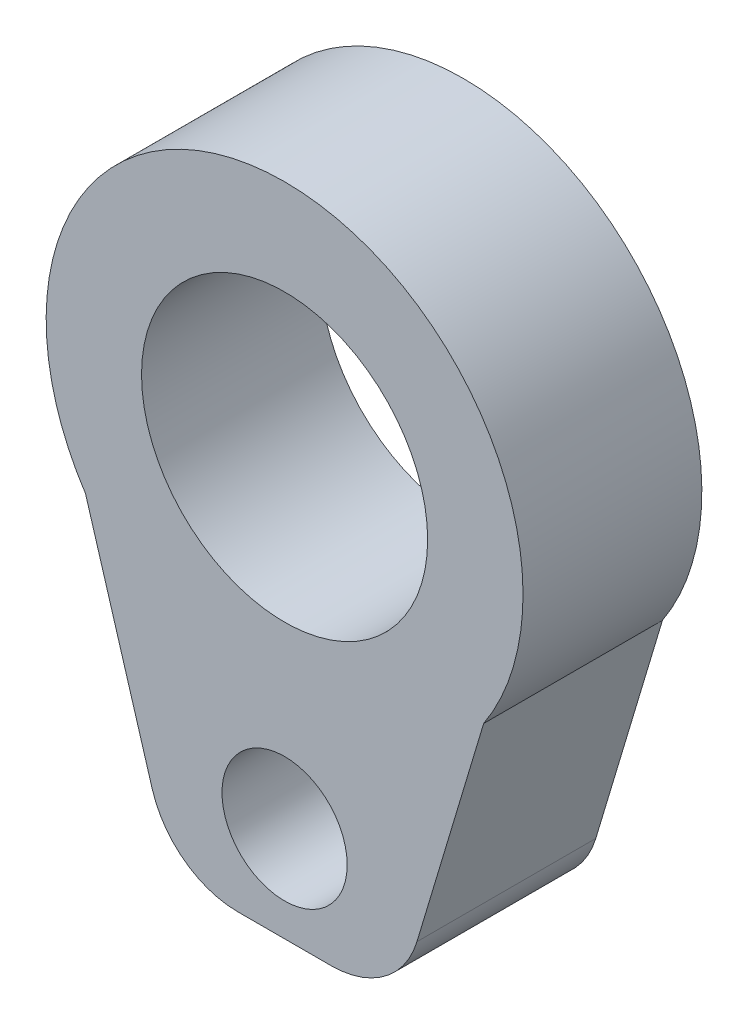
from build123d import *

# Parameters (mm, degrees)
SKIZZE1_R                       = 4
AUFSATZ_LINEAR_AUSTRAGEN1_DEPTH = 3
AUFSATZ_LINEAR_AUSTRAGEN2_DEPTH = 3
SKIZZE3_R                       = 2.4
SCHNITT_LINEAR_AUSTRAGEN1_DEPTH = 3
VERRUNDUNG1_R                   = 1.5
SKIZZE4_R                       = 1.05
SCHNITT_LINEAR_AUSTRAGEN2_DEPTH = 3


with BuildPart() as part:
    # Skizze1 → Aufsatz-Linear austragen1 (new body)
    with BuildSketch(Plane.XY):
        Circle(SKIZZE1_R)
    extrude(amount=AUFSATZ_LINEAR_AUSTRAGEN1_DEPTH)

    # Skizze2 → Aufsatz-Linear austragen2 (add)
    with BuildSketch(Plane(origin=(0, 0, 0), x_dir=(-1, 0, 0), z_dir=(0, 0, -1))):
        Polygon((-4, 0), (4, 0), (1.9, -7), (-1.9, -7), align=None)
    extrude(amount=-AUFSATZ_LINEAR_AUSTRAGEN2_DEPTH)

    # Skizze3 → Schnitt-Linear austragen1 (cut)
    with BuildSketch(Plane(origin=(0, 0, 0), x_dir=(-1, 0, 0), z_dir=(0, 0, -1))):
        Circle(SKIZZE3_R)
    extrude(amount=-SCHNITT_LINEAR_AUSTRAGEN1_DEPTH, mode=Mode.SUBTRACT)

    # Verrundung1
    verrundung1_edges = [part.edges().sort_by_distance(p)[0] for p in [
        (1.9, -7, 1.5),
        (-1.9, -7, 1.5),
    ]]
    fillet(verrundung1_edges, radius=VERRUNDUNG1_R)

    # Skizze4 → Schnitt-Linear austragen2 (cut)
    with BuildSketch(Plane.XY.offset(3)):
        with Locations((0, -5.4)):
            Circle(SKIZZE4_R)
    extrude(amount=-SCHNITT_LINEAR_AUSTRAGEN2_DEPTH, mode=Mode.SUBTRACT)


solid = part.part
